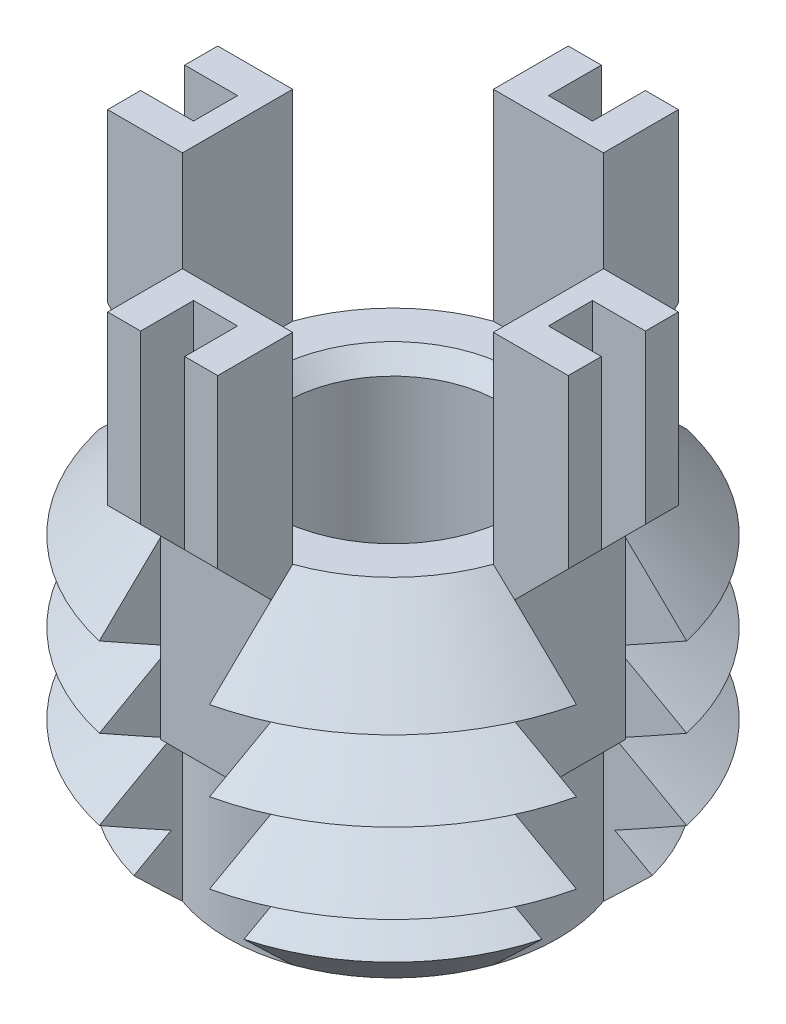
from build123d import *

# Parameters (mm, degrees)
SKETCH1_R               = 5.556
BOSS_EXTRUDE1_DEPTH     = 7.874
CHAMFER1_SIZE           = 1.814
LPATTERN1_COUNT         = 3
LPATTERN1_PITCH         = 1.814
CUT_EXTRUDE1_REACH      = 13.124
CIRPATTERN1_COUNT       = 4
BOSS_EXTRUDE3_DEPTH     = 1.25
CIRPATTERN2_COUNT       = 4
CUT_EXTRUDE3_DEPTH      = 15.600270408
CUT_EXTRUDE3_DEPTH_BACK = 15.600270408
SKETCH6_W               = 1.2
SKETCH6_H               = 1
SKETCH6_W_2             = 1
SKETCH6_H_2             = 1.2
SKETCH7_R               = 2.413
CUT_EXTRUDE4_DEPTH      = 7.874
CHAMFER2_SIZE           = 0.397


with BuildPart() as part:
    # Sketch1 → Boss-Extrude1 (new body)
    with BuildSketch(Plane(origin=(0, 0, 0), x_dir=(1, 0, 0), z_dir=(0, 1, 0))):
        with Locations(Location((0, 0, 0), (0, 0, 270))):
            Circle(SKETCH1_R)
    extrude(amount=-BOSS_EXTRUDE1_DEPTH)

    # Chamfer1
    chamfer1_edges = [part.edges().sort_by_distance(p)[0] for p in [
        (0, 0, -5.556),
        (0, -7.874, -5.556),
    ]]
    chamfer(chamfer1_edges, length=CHAMFER1_SIZE)

    # Sketch3 → Cut-Revolve1 (revolve, cut)
    with BuildSketch(Plane(origin=(0, 0, 0), x_dir=(0, 0, -1), z_dir=(1, 0, 0))):
        Polygon((-5.556, -1.814), (-3.985029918, -2.721), (-5.556, -3.628), align=None)
    cut_revolve1 = revolve(axis=Axis((0, 0.885892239, 0), (0, -1, 0)), mode=Mode.SUBTRACT)

    # LPattern1: Cut-Revolve1 ×3
    with Locations(*[(0, -i * LPATTERN1_PITCH, 0) for i in range(1, LPATTERN1_COUNT)]):
        add(cut_revolve1, mode=Mode.SUBTRACT)

    # Cut-Extrude1: up to this cone (the profile starts inside it)
    cut_extrude1_end = Plane(origin=(0, 0, 0), z_dir=(0, 1, 0)).offset(-11.615999) * Cone(1e-06, 36.856, 36.855999, align=(Align.CENTER, Align.CENTER, Align.MIN), mode=Mode.PRIVATE)
    # Sketch4 → Cut-Extrude1 (cut, up to the surface)
    with BuildSketch(Plane(origin=(0, 0, 0), x_dir=(1, 0, 0), z_dir=(0, 1, 0)), mode=Mode.PRIVATE) as cut_extrude1_sk1:
        with BuildLine():
            Line((-3.52704749, 1.25), (-5.413560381, 1.25))
            ThreePointArc((-5.413560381, 1.25), (-5.556, 0), (-5.413560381, -1.25))
            Line((-5.413560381, -1.25), (-3.52704749, -1.25))
            ThreePointArc((-3.52704749, -1.25), (-3.742, 0), (-3.52704749, 1.25))
        make_face()
    cut_extrude1_tool1 = extrude(cut_extrude1_sk1.sketch, amount=-CUT_EXTRUDE1_REACH, mode=Mode.PRIVATE) & cut_extrude1_end
    cut_extrude1 = cut_extrude1_tool1.solids().sort_by_distance((-4.589361, 0, 0))[0]
    add(cut_extrude1, mode=Mode.SUBTRACT)

    # CirPattern1: Cut-Extrude1 ×4 about axis
    cirpattern1_axis = Axis((0, 0, 0), (0, 1, 0))
    for i in range(1, CIRPATTERN1_COUNT):
        add(cut_extrude1.rotate(cirpattern1_axis, i * 360 / CIRPATTERN1_COUNT), mode=Mode.SUBTRACT)

    # Sketch5 → Boss-Extrude3 (add, symmetric)
    with BuildSketch(Plane(origin=(0, 0, 0), x_dir=(0, 0, -1), z_dir=(1, 0, 0))):
        Polygon((-3.52704749, 4.558), (-3.52704749, -4.442), (-4.02704749, -4.442), (-4.02704749, -0.442), (-5.22704749, 0.758), (-5.22704749, 4.558), align=None)
    boss_extrude3 = extrude(amount=BOSS_EXTRUDE3_DEPTH, both=True)

    # CirPattern2: Boss-Extrude3 ×4 about axis
    cirpattern2_axis = Axis((0, 0, 0), (0, 1, 0))
    for i in range(1, CIRPATTERN2_COUNT):
        add(boss_extrude3.rotate(cirpattern2_axis, i * 360 / CIRPATTERN2_COUNT))

    # Sketch6 → Cut-Extrude3 (cut, two sides: drawn at the far end of the back side and taken through both)
    with BuildSketch(Plane(origin=(0, 4.558, 0), x_dir=(1, 0, 0), z_dir=(0, 1, 0)).offset(-CUT_EXTRUDE3_DEPTH_BACK)):
        with Locations((-4.62704749, 0)):
            Rectangle(SKETCH6_W, SKETCH6_H)
        with Locations((0, 4.62704749)):
            Rectangle(SKETCH6_W_2, SKETCH6_H_2)
        with Locations((4.62704749, 0)):
            Rectangle(SKETCH6_W, SKETCH6_H)
        with Locations((0, -4.62704749)):
            Rectangle(SKETCH6_W_2, SKETCH6_H_2)
    extrude(amount=CUT_EXTRUDE3_DEPTH + CUT_EXTRUDE3_DEPTH_BACK, mode=Mode.SUBTRACT)

    # Sketch7 → Cut-Extrude4 (cut)
    with BuildSketch(Plane(origin=(0, 0, 0), x_dir=(1, 0, 0), z_dir=(0, 1, 0))):
        with Locations(Location((0, 0, 0), (0, 0, 270))):
            Circle(SKETCH7_R)
    extrude(amount=-CUT_EXTRUDE4_DEPTH, mode=Mode.SUBTRACT)

    # Chamfer2
    chamfer2_edges = [part.edges().sort_by_distance(p)[0] for p in [
        (0, 0, -2.413),
        (0, -7.874, -2.413),
    ]]
    chamfer(chamfer2_edges, length=CHAMFER2_SIZE)


solid = part.part
